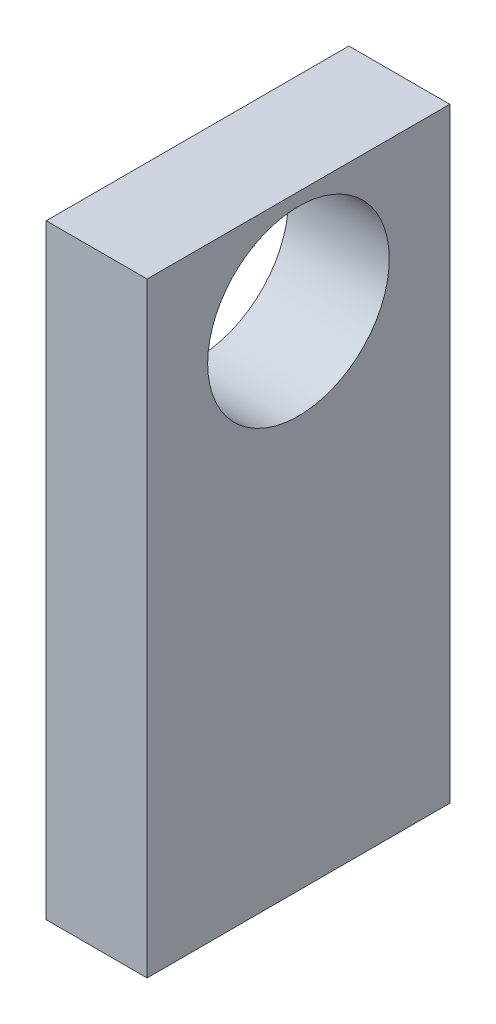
ISO-10303-21;
HEADER;
FILE_DESCRIPTION(('STEP AP214'),'2;1');
FILE_NAME('part.step','',(''),(''),'','','');
FILE_SCHEMA(('AUTOMOTIVE_DESIGN { 1 0 10303 214 1 1 1 1 }'));
ENDSEC;
DATA;
#1=APPLICATION_CONTEXT('core data for automotive mechanical design processes');
#2=APPLICATION_PROTOCOL_DEFINITION('international standard','automotive_design',2000,#1);
#3=PRODUCT_CONTEXT('',#1,'mechanical');
#4=PRODUCT('Part','Part','',(#3));
#5=PRODUCT_RELATED_PRODUCT_CATEGORY('part','',(#4));
#6=PRODUCT_DEFINITION_FORMATION('','',#4);
#7=PRODUCT_DEFINITION_CONTEXT('part definition',#1,'design');
#8=PRODUCT_DEFINITION('design','',#6,#7);
#9=PRODUCT_DEFINITION_SHAPE('','',#8);
#10=(LENGTH_UNIT() NAMED_UNIT(*) SI_UNIT(.MILLI.,.METRE.));
#11=(NAMED_UNIT(*) PLANE_ANGLE_UNIT() SI_UNIT($,.RADIAN.));
#12=(NAMED_UNIT(*) SI_UNIT($,.STERADIAN.) SOLID_ANGLE_UNIT());
#13=UNCERTAINTY_MEASURE_WITH_UNIT(LENGTH_MEASURE(1.E-05),#10,'distance_accuracy_value','');
#14=(GEOMETRIC_REPRESENTATION_CONTEXT(3) GLOBAL_UNCERTAINTY_ASSIGNED_CONTEXT((#13)) GLOBAL_UNIT_ASSIGNED_CONTEXT((#10,
#11,#12)) REPRESENTATION_CONTEXT('',''));
#15=CARTESIAN_POINT('',(0.,0.,0.));
#16=DIRECTION('',(0.,0.,1.));
#17=DIRECTION('',(1.,0.,0.));
#18=AXIS2_PLACEMENT_3D('',#15,#16,#17);
#19=CARTESIAN_POINT('',(3.175,38.1,9.525));
#20=DIRECTION('',(-1.,0.,0.));
#21=DIRECTION('',(0.,0.,1.));
#22=AXIS2_PLACEMENT_3D('',#19,#20,#21);
#23=PLANE('',#22);
#24=CARTESIAN_POINT('',(3.175,31.5812724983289,0.));
#25=DIRECTION('',(1.,0.,0.));
#26=DIRECTION('',(0.,0.,-1.));
#27=AXIS2_PLACEMENT_3D('',#24,#25,#26);
#28=CIRCLE('',#27,5.715);
#29=CARTESIAN_POINT('',(3.175,31.5812724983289,-5.715));
#30=VERTEX_POINT('',#29);
#31=EDGE_CURVE('E112',#30,#30,#28,.T.);
#32=ORIENTED_EDGE('',*,*,#31,.F.);
#33=EDGE_LOOP('',(#32));
#34=FACE_BOUND('',#33,.T.);
#35=DIRECTION('',(0.,0.,-1.));
#36=VECTOR('',#35,1.);
#37=CARTESIAN_POINT('',(3.175,0.,9.525));
#38=LINE('',#37,#36);
#39=CARTESIAN_POINT('',(3.175,0.,9.525));
#40=VERTEX_POINT('',#39);
#41=CARTESIAN_POINT('',(3.175,0.,-9.525));
#42=VERTEX_POINT('',#41);
#43=EDGE_CURVE('E96',#40,#42,#38,.T.);
#44=ORIENTED_EDGE('',*,*,#43,.T.);
#45=DIRECTION('',(0.,-1.,0.));
#46=VECTOR('',#45,1.);
#47=CARTESIAN_POINT('',(3.175,38.1,-9.525));
#48=LINE('',#47,#46);
#49=CARTESIAN_POINT('',(3.175,38.1,-9.525));
#50=VERTEX_POINT('',#49);
#51=EDGE_CURVE('E11',#50,#42,#48,.T.);
#52=ORIENTED_EDGE('',*,*,#51,.F.);
#53=DIRECTION('',(0.,0.,-1.));
#54=VECTOR('',#53,1.);
#55=CARTESIAN_POINT('',(3.175,38.1,9.525));
#56=LINE('',#55,#54);
#57=CARTESIAN_POINT('',(3.175,38.1,9.525));
#58=VERTEX_POINT('',#57);
#59=EDGE_CURVE('E84',#58,#50,#56,.T.);
#60=ORIENTED_EDGE('',*,*,#59,.F.);
#61=DIRECTION('',(0.,-1.,0.));
#62=VECTOR('',#61,1.);
#63=CARTESIAN_POINT('',(3.175,38.1,9.525));
#64=LINE('',#63,#62);
#65=EDGE_CURVE('E92',#58,#40,#64,.T.);
#66=ORIENTED_EDGE('',*,*,#65,.T.);
#67=EDGE_LOOP('',(#44,#52,#60,#66));
#68=FACE_BOUND('',#67,.T.);
#69=ADVANCED_FACE('F33',(#34,#68),#23,.F.);
#70=CARTESIAN_POINT('',(-3.175,38.1,-9.525));
#71=DIRECTION('',(0.,0.,1.));
#72=DIRECTION('',(1.,0.,0.));
#73=AXIS2_PLACEMENT_3D('',#70,#71,#72);
#74=PLANE('',#73);
#75=DIRECTION('',(-1.,0.,0.));
#76=VECTOR('',#75,1.);
#77=CARTESIAN_POINT('',(-3.175,0.,-9.525));
#78=LINE('',#77,#76);
#79=CARTESIAN_POINT('',(-3.175,0.,-9.525));
#80=VERTEX_POINT('',#79);
#81=EDGE_CURVE('E88',#42,#80,#78,.T.);
#82=ORIENTED_EDGE('',*,*,#81,.T.);
#83=DIRECTION('',(0.,-1.,0.));
#84=VECTOR('',#83,1.);
#85=CARTESIAN_POINT('',(-3.175,38.1,-9.525));
#86=LINE('',#85,#84);
#87=CARTESIAN_POINT('',(-3.175,38.1,-9.525));
#88=VERTEX_POINT('',#87);
#89=EDGE_CURVE('E41',#88,#80,#86,.T.);
#90=ORIENTED_EDGE('',*,*,#89,.F.);
#91=DIRECTION('',(-1.,0.,0.));
#92=VECTOR('',#91,1.);
#93=CARTESIAN_POINT('',(-3.175,38.1,-9.525));
#94=LINE('',#93,#92);
#95=EDGE_CURVE('E79',#50,#88,#94,.T.);
#96=ORIENTED_EDGE('',*,*,#95,.F.);
#97=ORIENTED_EDGE('',*,*,#51,.T.);
#98=EDGE_LOOP('',(#82,#90,#96,#97));
#99=FACE_BOUND('',#98,.T.);
#100=ADVANCED_FACE('F87',(#99),#74,.F.);
#101=CARTESIAN_POINT('',(-3.175,38.1,9.525));
#102=DIRECTION('',(1.,0.,0.));
#103=DIRECTION('',(0.,0.,-1.));
#104=AXIS2_PLACEMENT_3D('',#101,#102,#103);
#105=PLANE('',#104);
#106=CARTESIAN_POINT('',(-3.175,31.5812724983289,0.));
#107=DIRECTION('',(1.,0.,0.));
#108=DIRECTION('',(0.,0.,-1.));
#109=AXIS2_PLACEMENT_3D('',#106,#107,#108);
#110=CIRCLE('',#109,5.715);
#111=CARTESIAN_POINT('',(-3.175,31.5812724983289,-5.715));
#112=VERTEX_POINT('',#111);
#113=EDGE_CURVE('E99',#112,#112,#110,.F.);
#114=ORIENTED_EDGE('',*,*,#113,.F.);
#115=EDGE_LOOP('',(#114));
#116=FACE_BOUND('',#115,.T.);
#117=DIRECTION('',(0.,0.,1.));
#118=VECTOR('',#117,1.);
#119=CARTESIAN_POINT('',(-3.175,0.,9.525));
#120=LINE('',#119,#118);
#121=CARTESIAN_POINT('',(-3.175,0.,9.525));
#122=VERTEX_POINT('',#121);
#123=EDGE_CURVE('E66',#80,#122,#120,.T.);
#124=ORIENTED_EDGE('',*,*,#123,.T.);
#125=DIRECTION('',(0.,-1.,0.));
#126=VECTOR('',#125,1.);
#127=CARTESIAN_POINT('',(-3.175,38.1,9.525));
#128=LINE('',#127,#126);
#129=CARTESIAN_POINT('',(-3.175,38.1,9.525));
#130=VERTEX_POINT('',#129);
#131=EDGE_CURVE('E89',#130,#122,#128,.T.);
#132=ORIENTED_EDGE('',*,*,#131,.F.);
#133=DIRECTION('',(0.,0.,1.));
#134=VECTOR('',#133,1.);
#135=CARTESIAN_POINT('',(-3.175,38.1,9.525));
#136=LINE('',#135,#134);
#137=EDGE_CURVE('E82',#88,#130,#136,.T.);
#138=ORIENTED_EDGE('',*,*,#137,.F.);
#139=ORIENTED_EDGE('',*,*,#89,.T.);
#140=EDGE_LOOP('',(#124,#132,#138,#139));
#141=FACE_BOUND('',#140,.T.);
#142=ADVANCED_FACE('F90',(#116,#141),#105,.F.);
#143=CARTESIAN_POINT('',(-3.175,38.1,9.525));
#144=DIRECTION('',(0.,0.,-1.));
#145=DIRECTION('',(-1.,0.,0.));
#146=AXIS2_PLACEMENT_3D('',#143,#144,#145);
#147=PLANE('',#146);
#148=DIRECTION('',(1.,0.,0.));
#149=VECTOR('',#148,1.);
#150=CARTESIAN_POINT('',(-3.175,0.,9.525));
#151=LINE('',#150,#149);
#152=EDGE_CURVE('E72',#122,#40,#151,.T.);
#153=ORIENTED_EDGE('',*,*,#152,.T.);
#154=ORIENTED_EDGE('',*,*,#65,.F.);
#155=DIRECTION('',(1.,0.,0.));
#156=VECTOR('',#155,1.);
#157=CARTESIAN_POINT('',(-3.175,38.1,9.525));
#158=LINE('',#157,#156);
#159=EDGE_CURVE('E49',#130,#58,#158,.T.);
#160=ORIENTED_EDGE('',*,*,#159,.F.);
#161=ORIENTED_EDGE('',*,*,#131,.T.);
#162=EDGE_LOOP('',(#153,#154,#160,#161));
#163=FACE_BOUND('',#162,.T.);
#164=ADVANCED_FACE('F104',(#163),#147,.F.);
#165=CARTESIAN_POINT('',(0.,38.1,0.));
#166=DIRECTION('',(0.,-1.,0.));
#167=DIRECTION('',(0.,0.,-1.));
#168=AXIS2_PLACEMENT_3D('',#165,#166,#167);
#169=PLANE('',#168);
#170=ORIENTED_EDGE('',*,*,#59,.T.);
#171=ORIENTED_EDGE('',*,*,#95,.T.);
#172=ORIENTED_EDGE('',*,*,#137,.T.);
#173=ORIENTED_EDGE('',*,*,#159,.T.);
#174=EDGE_LOOP('',(#170,#171,#172,#173));
#175=FACE_BOUND('',#174,.T.);
#176=ADVANCED_FACE('F80',(#175),#169,.F.);
#177=CARTESIAN_POINT('',(0.,0.,0.));
#178=DIRECTION('',(0.,-1.,0.));
#179=DIRECTION('',(0.,0.,-1.));
#180=AXIS2_PLACEMENT_3D('',#177,#178,#179);
#181=PLANE('',#180);
#182=ORIENTED_EDGE('',*,*,#43,.F.);
#183=ORIENTED_EDGE('',*,*,#152,.F.);
#184=ORIENTED_EDGE('',*,*,#123,.F.);
#185=ORIENTED_EDGE('',*,*,#81,.F.);
#186=EDGE_LOOP('',(#182,#183,#184,#185));
#187=FACE_BOUND('',#186,.T.);
#188=ADVANCED_FACE('F107',(#187),#181,.T.);
#189=CARTESIAN_POINT('',(-3.176,31.5812724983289,0.));
#190=DIRECTION('',(1.,0.,0.));
#191=DIRECTION('',(0.,0.,-1.));
#192=AXIS2_PLACEMENT_3D('',#189,#190,#191);
#193=CYLINDRICAL_SURFACE('',#192,5.715);
#194=ORIENTED_EDGE('',*,*,#31,.T.);
#195=EDGE_LOOP('',(#194));
#196=FACE_BOUND('',#195,.T.);
#197=ORIENTED_EDGE('',*,*,#113,.T.);
#198=EDGE_LOOP('',(#197));
#199=FACE_BOUND('',#198,.T.);
#200=ADVANCED_FACE('F116',(#196,#199),#193,.F.);
#201=CLOSED_SHELL('',(#69,#100,#142,#164,#176,#188,#200));
#202=MANIFOLD_SOLID_BREP('B2',#201);
#203=ADVANCED_BREP_SHAPE_REPRESENTATION('',(#18,#202),#14);
#204=SHAPE_DEFINITION_REPRESENTATION(#9,#203);
ENDSEC;
END-ISO-10303-21;
